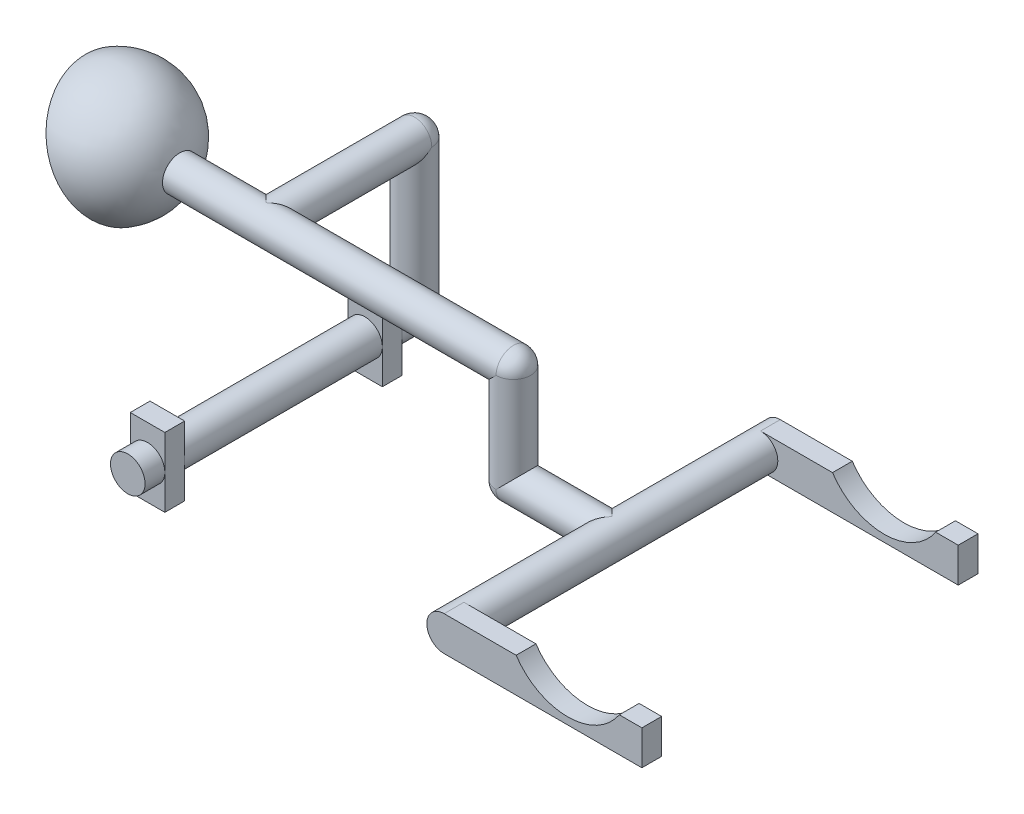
ISO-10303-21;
HEADER;
FILE_DESCRIPTION(('STEP AP214'),'2;1');
FILE_NAME('part.step','',(''),(''),'','','');
FILE_SCHEMA(('AUTOMOTIVE_DESIGN { 1 0 10303 214 1 1 1 1 }'));
ENDSEC;
DATA;
#1=APPLICATION_CONTEXT('core data for automotive mechanical design processes');
#2=APPLICATION_PROTOCOL_DEFINITION('international standard','automotive_design',2000,#1);
#3=PRODUCT_CONTEXT('',#1,'mechanical');
#4=PRODUCT('Part','Part','',(#3));
#5=PRODUCT_RELATED_PRODUCT_CATEGORY('part','',(#4));
#6=PRODUCT_DEFINITION_FORMATION('','',#4);
#7=PRODUCT_DEFINITION_CONTEXT('part definition',#1,'design');
#8=PRODUCT_DEFINITION('design','',#6,#7);
#9=PRODUCT_DEFINITION_SHAPE('','',#8);
#10=(LENGTH_UNIT() NAMED_UNIT(*) SI_UNIT(.MILLI.,.METRE.));
#11=(NAMED_UNIT(*) PLANE_ANGLE_UNIT() SI_UNIT($,.RADIAN.));
#12=(NAMED_UNIT(*) SI_UNIT($,.STERADIAN.) SOLID_ANGLE_UNIT());
#13=UNCERTAINTY_MEASURE_WITH_UNIT(LENGTH_MEASURE(1.E-05),#10,'distance_accuracy_value','');
#14=(GEOMETRIC_REPRESENTATION_CONTEXT(3) GLOBAL_UNCERTAINTY_ASSIGNED_CONTEXT((#13)) GLOBAL_UNIT_ASSIGNED_CONTEXT((#10,
#11,#12)) REPRESENTATION_CONTEXT('',''));
#15=CARTESIAN_POINT('',(0.,0.,0.));
#16=DIRECTION('',(0.,0.,1.));
#17=DIRECTION('',(1.,0.,0.));
#18=AXIS2_PLACEMENT_3D('',#15,#16,#17);
#19=CARTESIAN_POINT('',(-36.5286945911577,11.2417145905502,-24.));
#20=DIRECTION('',(0.864747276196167,0.502207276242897,0.));
#21=DIRECTION('',(-0.502207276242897,0.864747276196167,0.));
#22=AXIS2_PLACEMENT_3D('',#19,#20,#21);
#23=PLANE('',#22);
#24=CARTESIAN_POINT('',(-30.,0.,0.));
#25=DIRECTION('',(0.864747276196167,0.502207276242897,0.));
#26=DIRECTION('',(-0.502207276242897,0.864747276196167,0.));
#27=AXIS2_PLACEMENT_3D('',#24,#25,#26);
#28=CIRCLE('',#27,13.);
#29=CARTESIAN_POINT('',(-36.5286945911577,11.2417145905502,0.));
#30=VERTEX_POINT('',#29);
#31=EDGE_CURVE('E11',#30,#30,#28,.T.);
#32=ORIENTED_EDGE('',*,*,#31,.F.);
#33=EDGE_LOOP('',(#32));
#34=FACE_BOUND('',#33,.T.);
#35=CARTESIAN_POINT('',(-30.,0.,0.));
#36=DIRECTION('',(0.864747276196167,0.502207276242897,0.));
#37=DIRECTION('',(-0.502207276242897,0.864747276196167,0.));
#38=AXIS2_PLACEMENT_3D('',#35,#36,#37);
#39=CIRCLE('',#38,10.);
#40=CARTESIAN_POINT('',(-35.022072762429,8.64747276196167,0.));
#41=VERTEX_POINT('',#40);
#42=EDGE_CURVE('E36',#41,#41,#39,.F.);
#43=ORIENTED_EDGE('',*,*,#42,.F.);
#44=EDGE_LOOP('',(#43));
#45=FACE_BOUND('',#44,.T.);
#46=ADVANCED_FACE('F32',(#34,#45),#23,.F.);
#47=CARTESIAN_POINT('',(34.9353180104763,-20.,0.));
#48=DIRECTION('',(-1.,0.,0.));
#49=DIRECTION('',(0.,0.,1.));
#50=AXIS2_PLACEMENT_3D('',#47,#48,#49);
#51=CYLINDRICAL_SURFACE('',#50,3.5);
#52=CARTESIAN_POINT('',(50.,-20.,0.));
#53=DIRECTION('',(-0.707106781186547,0.707106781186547,0.));
#54=DIRECTION('',(0.707106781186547,0.707106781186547,0.));
#55=AXIS2_PLACEMENT_3D('',#52,#53,#54);
#56=ELLIPSE('',#55,4.94974746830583,3.5);
#57=CARTESIAN_POINT('',(50.,-20.,3.5));
#58=VERTEX_POINT('',#57);
#59=CARTESIAN_POINT('',(50.,-20.,-3.5));
#60=VERTEX_POINT('',#59);
#61=EDGE_CURVE('E249',#58,#60,#56,.T.);
#62=ORIENTED_EDGE('',*,*,#61,.F.);
#63=CARTESIAN_POINT('',(50.,-20.,0.));
#64=DIRECTION('',(-1.,0.,0.));
#65=DIRECTION('',(0.,0.,1.));
#66=AXIS2_PLACEMENT_3D('',#63,#64,#65);
#67=CIRCLE('',#66,3.5);
#68=EDGE_CURVE('E253',#60,#58,#67,.T.);
#69=ORIENTED_EDGE('',*,*,#68,.F.);
#70=EDGE_LOOP('',(#62,#69));
#71=FACE_BOUND('',#70,.T.);
#72=CARTESIAN_POINT('',(70.,-20.,0.));
#73=DIRECTION('',(-0.707106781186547,0.,-0.707106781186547));
#74=DIRECTION('',(-0.707106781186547,0.,0.707106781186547));
#75=AXIS2_PLACEMENT_3D('',#72,#73,#74);
#76=ELLIPSE('',#75,4.94974746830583,3.5);
#77=CARTESIAN_POINT('',(70.,-16.5,0.));
#78=VERTEX_POINT('',#77);
#79=CARTESIAN_POINT('',(70.,-23.5,0.));
#80=VERTEX_POINT('',#79);
#81=EDGE_CURVE('E481',#78,#80,#76,.F.);
#82=ORIENTED_EDGE('',*,*,#81,.F.);
#83=CARTESIAN_POINT('',(70.,-20.,0.));
#84=DIRECTION('',(-0.707106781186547,0.,0.707106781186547));
#85=DIRECTION('',(-0.707106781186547,0.,-0.707106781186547));
#86=AXIS2_PLACEMENT_3D('',#83,#84,#85);
#87=ELLIPSE('',#86,4.94974746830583,3.5);
#88=EDGE_CURVE('E371',#80,#78,#87,.F.);
#89=ORIENTED_EDGE('',*,*,#88,.F.);
#90=EDGE_LOOP('',(#82,#89));
#91=FACE_BOUND('',#90,.T.);
#92=ADVANCED_FACE('F489',(#71,#91),#51,.T.);
#93=CARTESIAN_POINT('',(50.,-20.,0.));
#94=DIRECTION('',(0.,1.,0.));
#95=DIRECTION('',(0.,0.,1.));
#96=AXIS2_PLACEMENT_3D('',#93,#94,#95);
#97=CYLINDRICAL_SURFACE('',#96,3.5);
#98=CARTESIAN_POINT('',(50.,0.,0.));
#99=DIRECTION('',(-0.707106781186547,0.707106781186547,0.));
#100=DIRECTION('',(-0.707106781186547,-0.707106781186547,0.));
#101=AXIS2_PLACEMENT_3D('',#98,#99,#100);
#102=ELLIPSE('',#101,4.94974746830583,3.5);
#103=CARTESIAN_POINT('',(50.,0.,-3.5));
#104=VERTEX_POINT('',#103);
#105=CARTESIAN_POINT('',(50.,0.,3.5));
#106=VERTEX_POINT('',#105);
#107=EDGE_CURVE('E231',#104,#106,#102,.T.);
#108=ORIENTED_EDGE('',*,*,#107,.F.);
#109=CARTESIAN_POINT('',(50.,0.,0.));
#110=DIRECTION('',(0.,1.,0.));
#111=DIRECTION('',(0.,0.,1.));
#112=AXIS2_PLACEMENT_3D('',#109,#110,#111);
#113=CIRCLE('',#112,3.5);
#114=EDGE_CURVE('E236',#106,#104,#113,.T.);
#115=ORIENTED_EDGE('',*,*,#114,.F.);
#116=EDGE_LOOP('',(#108,#115));
#117=FACE_BOUND('',#116,.T.);
#118=CARTESIAN_POINT('',(50.,-20.,0.));
#119=DIRECTION('',(0.,1.,0.));
#120=DIRECTION('',(0.,0.,1.));
#121=AXIS2_PLACEMENT_3D('',#118,#119,#120);
#122=CIRCLE('',#121,3.5);
#123=EDGE_CURVE('E240',#60,#58,#122,.T.);
#124=ORIENTED_EDGE('',*,*,#123,.T.);
#125=ORIENTED_EDGE('',*,*,#61,.T.);
#126=EDGE_LOOP('',(#124,#125));
#127=FACE_BOUND('',#126,.T.);
#128=ADVANCED_FACE('F233',(#117,#127),#97,.T.);
#129=CARTESIAN_POINT('',(50.,0.,0.));
#130=DIRECTION('',(-1.,0.,0.));
#131=DIRECTION('',(0.,0.,1.));
#132=AXIS2_PLACEMENT_3D('',#129,#130,#131);
#133=CYLINDRICAL_SURFACE('',#132,3.5);
#134=CARTESIAN_POINT('',(50.,0.,0.));
#135=DIRECTION('',(1.,0.,0.));
#136=DIRECTION('',(0.,0.,-1.));
#137=AXIS2_PLACEMENT_3D('',#134,#135,#136);
#138=CIRCLE('',#137,3.5);
#139=EDGE_CURVE('E242',#104,#106,#138,.T.);
#140=ORIENTED_EDGE('',*,*,#139,.F.);
#141=ORIENTED_EDGE('',*,*,#107,.T.);
#142=EDGE_LOOP('',(#140,#141));
#143=FACE_BOUND('',#142,.T.);
#144=CARTESIAN_POINT('',(0.,0.,0.));
#145=DIRECTION('',(-0.707106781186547,0.,-0.707106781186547));
#146=DIRECTION('',(-0.707106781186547,0.,0.707106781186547));
#147=AXIS2_PLACEMENT_3D('',#144,#145,#146);
#148=ELLIPSE('',#147,4.94974746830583,3.5);
#149=CARTESIAN_POINT('',(0.,-3.5,0.));
#150=VERTEX_POINT('',#149);
#151=CARTESIAN_POINT('',(0.,3.5,0.));
#152=VERTEX_POINT('',#151);
#153=EDGE_CURVE('E245',#150,#152,#148,.F.);
#154=ORIENTED_EDGE('',*,*,#153,.T.);
#155=CARTESIAN_POINT('',(0.,0.,0.));
#156=DIRECTION('',(-0.707106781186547,0.,0.707106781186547));
#157=DIRECTION('',(-0.707106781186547,0.,-0.707106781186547));
#158=AXIS2_PLACEMENT_3D('',#155,#156,#157);
#159=ELLIPSE('',#158,4.94974746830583,3.5);
#160=EDGE_CURVE('E363',#152,#150,#159,.T.);
#161=ORIENTED_EDGE('',*,*,#160,.T.);
#162=EDGE_LOOP('',(#154,#161));
#163=FACE_BOUND('',#162,.T.);
#164=CARTESIAN_POINT('',(-17.4800159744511,0.,0.));
#165=DIRECTION('',(-1.,0.,0.));
#166=DIRECTION('',(0.,0.,1.));
#167=AXIS2_PLACEMENT_3D('',#164,#165,#166);
#168=CIRCLE('',#167,3.5);
#169=CARTESIAN_POINT('',(-17.4800159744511,0.,3.5));
#170=VERTEX_POINT('',#169);
#171=EDGE_CURVE('E41',#170,#170,#168,.T.);
#172=ORIENTED_EDGE('',*,*,#171,.F.);
#173=EDGE_LOOP('',(#172));
#174=FACE_BOUND('',#173,.T.);
#175=ADVANCED_FACE('F34',(#143,#163,#174),#133,.T.);
#176=CARTESIAN_POINT('',(-3.5,-37.,24.));
#177=DIRECTION('',(0.,0.,1.));
#178=DIRECTION('',(1.,0.,0.));
#179=AXIS2_PLACEMENT_3D('',#176,#177,#178);
#180=PLANE('',#179);
#181=CARTESIAN_POINT('',(0.,-30.,24.));
#182=DIRECTION('',(0.,0.,1.));
#183=DIRECTION('',(1.,0.,0.));
#184=AXIS2_PLACEMENT_3D('',#181,#182,#183);
#185=CIRCLE('',#184,3.5);
#186=CARTESIAN_POINT('',(3.5,-30.,24.));
#187=VERTEX_POINT('',#186);
#188=CARTESIAN_POINT('',(-3.5,-30.,24.));
#189=VERTEX_POINT('',#188);
#190=EDGE_CURVE('E239',#187,#189,#185,.T.);
#191=ORIENTED_EDGE('',*,*,#190,.F.);
#192=DIRECTION('',(0.,1.,0.));
#193=VECTOR('',#192,1.);
#194=CARTESIAN_POINT('',(3.5,-37.,24.));
#195=LINE('',#194,#193);
#196=CARTESIAN_POINT('',(3.5,-23.,24.));
#197=VERTEX_POINT('',#196);
#198=EDGE_CURVE('E283',#187,#197,#195,.T.);
#199=ORIENTED_EDGE('',*,*,#198,.T.);
#200=DIRECTION('',(-1.,0.,0.));
#201=VECTOR('',#200,1.);
#202=CARTESIAN_POINT('',(3.5,-23.,24.));
#203=LINE('',#202,#201);
#204=CARTESIAN_POINT('',(-3.5,-23.,24.));
#205=VERTEX_POINT('',#204);
#206=EDGE_CURVE('E286',#197,#205,#203,.T.);
#207=ORIENTED_EDGE('',*,*,#206,.T.);
#208=DIRECTION('',(0.,-1.,0.));
#209=VECTOR('',#208,1.);
#210=CARTESIAN_POINT('',(-3.5,-23.,24.));
#211=LINE('',#210,#209);
#212=EDGE_CURVE('E278',#205,#189,#211,.T.);
#213=ORIENTED_EDGE('',*,*,#212,.T.);
#214=EDGE_LOOP('',(#191,#199,#207,#213));
#215=FACE_BOUND('',#214,.T.);
#216=ADVANCED_FACE('F497',(#215),#180,.T.);
#217=CARTESIAN_POINT('',(3.5,-37.,-20.));
#218=DIRECTION('',(0.,0.,-1.));
#219=DIRECTION('',(-1.,0.,0.));
#220=AXIS2_PLACEMENT_3D('',#217,#218,#219);
#221=PLANE('',#220);
#222=CARTESIAN_POINT('',(0.,-30.,-20.));
#223=DIRECTION('',(0.,0.,1.));
#224=DIRECTION('',(1.,0.,0.));
#225=AXIS2_PLACEMENT_3D('',#222,#223,#224);
#226=CIRCLE('',#225,3.5);
#227=CARTESIAN_POINT('',(3.5,-30.,-20.));
#228=VERTEX_POINT('',#227);
#229=CARTESIAN_POINT('',(-3.5,-30.,-20.));
#230=VERTEX_POINT('',#229);
#231=EDGE_CURVE('E300',#228,#230,#226,.T.);
#232=ORIENTED_EDGE('',*,*,#231,.F.);
#233=DIRECTION('',(0.,1.,0.));
#234=VECTOR('',#233,1.);
#235=CARTESIAN_POINT('',(3.5,-23.,-20.));
#236=LINE('',#235,#234);
#237=CARTESIAN_POINT('',(3.5,-23.,-20.));
#238=VERTEX_POINT('',#237);
#239=EDGE_CURVE('E319',#228,#238,#236,.T.);
#240=ORIENTED_EDGE('',*,*,#239,.T.);
#241=DIRECTION('',(-1.,0.,0.));
#242=VECTOR('',#241,1.);
#243=CARTESIAN_POINT('',(3.5,-23.,-20.));
#244=LINE('',#243,#242);
#245=CARTESIAN_POINT('',(-3.5,-23.,-20.));
#246=VERTEX_POINT('',#245);
#247=EDGE_CURVE('E322',#238,#246,#244,.T.);
#248=ORIENTED_EDGE('',*,*,#247,.T.);
#249=DIRECTION('',(0.,-1.,0.));
#250=VECTOR('',#249,1.);
#251=CARTESIAN_POINT('',(-3.5,-23.,-20.));
#252=LINE('',#251,#250);
#253=EDGE_CURVE('E325',#246,#230,#252,.T.);
#254=ORIENTED_EDGE('',*,*,#253,.T.);
#255=EDGE_LOOP('',(#232,#240,#248,#254));
#256=FACE_BOUND('',#255,.T.);
#257=ADVANCED_FACE('F631',(#256),#221,.F.);
#258=EDGE_CURVE('E304',#230,#228,#226,.T.);
#259=ORIENTED_EDGE('',*,*,#258,.F.);
#260=CARTESIAN_POINT('',(-3.5,-37.,-20.));
#261=VERTEX_POINT('',#260);
#262=EDGE_CURVE('E324',#230,#261,#252,.T.);
#263=ORIENTED_EDGE('',*,*,#262,.T.);
#264=DIRECTION('',(1.,0.,0.));
#265=VECTOR('',#264,1.);
#266=CARTESIAN_POINT('',(3.5,-37.,-20.));
#267=LINE('',#266,#265);
#268=CARTESIAN_POINT('',(3.5,-37.,-20.));
#269=VERTEX_POINT('',#268);
#270=EDGE_CURVE('E328',#261,#269,#267,.T.);
#271=ORIENTED_EDGE('',*,*,#270,.T.);
#272=EDGE_CURVE('E320',#269,#228,#236,.T.);
#273=ORIENTED_EDGE('',*,*,#272,.T.);
#274=EDGE_LOOP('',(#259,#263,#271,#273));
#275=FACE_BOUND('',#274,.T.);
#276=ADVANCED_FACE('F634',(#275),#221,.F.);
#277=CARTESIAN_POINT('',(0.,0.,-30.));
#278=DIRECTION('',(0.,0.,1.));
#279=DIRECTION('',(1.,0.,0.));
#280=AXIS2_PLACEMENT_3D('',#277,#278,#279);
#281=CYLINDRICAL_SURFACE('',#280,3.5);
#282=CARTESIAN_POINT('',(0.,0.,-30.));
#283=DIRECTION('',(0.,0.707106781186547,0.707106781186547));
#284=DIRECTION('',(0.,-0.707106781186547,0.707106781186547));
#285=AXIS2_PLACEMENT_3D('',#282,#283,#284);
#286=ELLIPSE('',#285,4.94974746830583,3.5);
#287=CARTESIAN_POINT('',(3.5,0.,-30.));
#288=VERTEX_POINT('',#287);
#289=CARTESIAN_POINT('',(-3.5,0.,-30.));
#290=VERTEX_POINT('',#289);
#291=EDGE_CURVE('E357',#288,#290,#286,.F.);
#292=ORIENTED_EDGE('',*,*,#291,.F.);
#293=CARTESIAN_POINT('',(0.,0.,-30.));
#294=DIRECTION('',(0.,0.,1.));
#295=DIRECTION('',(1.,0.,0.));
#296=AXIS2_PLACEMENT_3D('',#293,#294,#295);
#297=CIRCLE('',#296,3.5);
#298=EDGE_CURVE('E246',#288,#290,#297,.T.);
#299=ORIENTED_EDGE('',*,*,#298,.T.);
#300=EDGE_LOOP('',(#292,#299));
#301=FACE_BOUND('',#300,.T.);
#302=ORIENTED_EDGE('',*,*,#160,.F.);
#303=ORIENTED_EDGE('',*,*,#153,.F.);
#304=EDGE_LOOP('',(#302,#303));
#305=FACE_BOUND('',#304,.T.);
#306=ADVANCED_FACE('F656',(#301,#305),#281,.T.);
#307=CARTESIAN_POINT('',(0.,-30.,-30.));
#308=DIRECTION('',(0.,1.,0.));
#309=DIRECTION('',(0.,0.,1.));
#310=AXIS2_PLACEMENT_3D('',#307,#308,#309);
#311=CYLINDRICAL_SURFACE('',#310,3.5);
#312=CARTESIAN_POINT('',(0.,-30.,-30.));
#313=DIRECTION('',(0.,0.707106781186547,-0.707106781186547));
#314=DIRECTION('',(0.,0.707106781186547,0.707106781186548));
#315=AXIS2_PLACEMENT_3D('',#312,#313,#314);
#316=ELLIPSE('',#315,4.94974746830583,3.5);
#317=CARTESIAN_POINT('',(3.5,-30.,-30.));
#318=VERTEX_POINT('',#317);
#319=CARTESIAN_POINT('',(-3.5,-30.,-30.));
#320=VERTEX_POINT('',#319);
#321=EDGE_CURVE('E349',#318,#320,#316,.F.);
#322=ORIENTED_EDGE('',*,*,#321,.F.);
#323=CARTESIAN_POINT('',(0.,-30.,-30.));
#324=DIRECTION('',(0.,1.,0.));
#325=DIRECTION('',(0.,0.,1.));
#326=AXIS2_PLACEMENT_3D('',#323,#324,#325);
#327=CIRCLE('',#326,3.5);
#328=EDGE_CURVE('E355',#318,#320,#327,.T.);
#329=ORIENTED_EDGE('',*,*,#328,.T.);
#330=EDGE_LOOP('',(#322,#329));
#331=FACE_BOUND('',#330,.T.);
#332=CARTESIAN_POINT('',(0.,0.,-30.));
#333=DIRECTION('',(0.,1.,0.));
#334=DIRECTION('',(0.,0.,1.));
#335=AXIS2_PLACEMENT_3D('',#332,#333,#334);
#336=CIRCLE('',#335,3.5);
#337=EDGE_CURVE('E352',#288,#290,#336,.T.);
#338=ORIENTED_EDGE('',*,*,#337,.F.);
#339=ORIENTED_EDGE('',*,*,#291,.T.);
#340=EDGE_LOOP('',(#338,#339));
#341=FACE_BOUND('',#340,.T.);
#342=ADVANCED_FACE('F653',(#331,#341),#311,.T.);
#343=CARTESIAN_POINT('',(0.,-30.,-33.3032163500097));
#344=DIRECTION('',(0.,0.,-1.));
#345=DIRECTION('',(0.,1.,0.));
#346=AXIS2_PLACEMENT_3D('',#343,#344,#345);
#347=CYLINDRICAL_SURFACE('',#346,3.5);
#348=CARTESIAN_POINT('',(0.,-30.,-24.));
#349=DIRECTION('',(0.,0.,-1.));
#350=DIRECTION('',(0.,1.,0.));
#351=AXIS2_PLACEMENT_3D('',#348,#349,#350);
#352=CIRCLE('',#351,3.5);
#353=CARTESIAN_POINT('',(3.5,-30.,-24.));
#354=VERTEX_POINT('',#353);
#355=CARTESIAN_POINT('',(-3.5,-30.,-24.));
#356=VERTEX_POINT('',#355);
#357=EDGE_CURVE('E343',#354,#356,#352,.T.);
#358=ORIENTED_EDGE('',*,*,#357,.T.);
#359=EDGE_CURVE('E342',#356,#354,#352,.T.);
#360=ORIENTED_EDGE('',*,*,#359,.T.);
#361=EDGE_LOOP('',(#358,#360));
#362=FACE_BOUND('',#361,.T.);
#363=CARTESIAN_POINT('',(0.,-30.,-30.));
#364=DIRECTION('',(0.,0.,-1.));
#365=DIRECTION('',(0.,1.,0.));
#366=AXIS2_PLACEMENT_3D('',#363,#364,#365);
#367=CIRCLE('',#366,3.5);
#368=EDGE_CURVE('E346',#318,#320,#367,.T.);
#369=ORIENTED_EDGE('',*,*,#368,.F.);
#370=ORIENTED_EDGE('',*,*,#321,.T.);
#371=EDGE_LOOP('',(#369,#370));
#372=FACE_BOUND('',#371,.T.);
#373=ADVANCED_FACE('F629',(#362,#372),#347,.T.);
#374=CARTESIAN_POINT('',(3.5,-37.,-24.));
#375=DIRECTION('',(0.,0.,-1.));
#376=DIRECTION('',(-1.,0.,0.));
#377=AXIS2_PLACEMENT_3D('',#374,#375,#376);
#378=PLANE('',#377);
#379=ORIENTED_EDGE('',*,*,#357,.F.);
#380=DIRECTION('',(0.,1.,0.));
#381=VECTOR('',#380,1.);
#382=CARTESIAN_POINT('',(3.5,-23.,-24.));
#383=LINE('',#382,#381);
#384=CARTESIAN_POINT('',(3.5,-37.,-24.));
#385=VERTEX_POINT('',#384);
#386=EDGE_CURVE('E309',#385,#354,#383,.T.);
#387=ORIENTED_EDGE('',*,*,#386,.F.);
#388=DIRECTION('',(1.,0.,0.));
#389=VECTOR('',#388,1.);
#390=CARTESIAN_POINT('',(3.5,-37.,-24.));
#391=LINE('',#390,#389);
#392=CARTESIAN_POINT('',(-3.5,-37.,-24.));
#393=VERTEX_POINT('',#392);
#394=EDGE_CURVE('E317',#393,#385,#391,.T.);
#395=ORIENTED_EDGE('',*,*,#394,.F.);
#396=DIRECTION('',(0.,-1.,0.));
#397=VECTOR('',#396,1.);
#398=CARTESIAN_POINT('',(-3.5,-23.,-24.));
#399=LINE('',#398,#397);
#400=EDGE_CURVE('E313',#356,#393,#399,.T.);
#401=ORIENTED_EDGE('',*,*,#400,.F.);
#402=EDGE_LOOP('',(#379,#387,#395,#401));
#403=FACE_BOUND('',#402,.T.);
#404=ADVANCED_FACE('F625',(#403),#378,.T.);
#405=ORIENTED_EDGE('',*,*,#359,.F.);
#406=CARTESIAN_POINT('',(-3.5,-23.,-24.));
#407=VERTEX_POINT('',#406);
#408=EDGE_CURVE('E314',#407,#356,#399,.T.);
#409=ORIENTED_EDGE('',*,*,#408,.F.);
#410=DIRECTION('',(-1.,0.,0.));
#411=VECTOR('',#410,1.);
#412=CARTESIAN_POINT('',(3.5,-23.,-24.));
#413=LINE('',#412,#411);
#414=CARTESIAN_POINT('',(3.5,-23.,-24.));
#415=VERTEX_POINT('',#414);
#416=EDGE_CURVE('E311',#415,#407,#413,.T.);
#417=ORIENTED_EDGE('',*,*,#416,.F.);
#418=EDGE_CURVE('E308',#354,#415,#383,.T.);
#419=ORIENTED_EDGE('',*,*,#418,.F.);
#420=EDGE_LOOP('',(#405,#409,#417,#419));
#421=FACE_BOUND('',#420,.T.);
#422=ADVANCED_FACE('F628',(#421),#378,.T.);
#423=CARTESIAN_POINT('',(3.5,-23.,-20.));
#424=DIRECTION('',(-1.,0.,0.));
#425=DIRECTION('',(0.,-1.,0.));
#426=AXIS2_PLACEMENT_3D('',#423,#424,#425);
#427=PLANE('',#426);
#428=ORIENTED_EDGE('',*,*,#386,.T.);
#429=ORIENTED_EDGE('',*,*,#418,.T.);
#430=DIRECTION('',(0.,0.,-1.));
#431=VECTOR('',#430,1.);
#432=CARTESIAN_POINT('',(3.5,-23.,-20.));
#433=LINE('',#432,#431);
#434=EDGE_CURVE('E339',#238,#415,#433,.T.);
#435=ORIENTED_EDGE('',*,*,#434,.F.);
#436=ORIENTED_EDGE('',*,*,#239,.F.);
#437=ORIENTED_EDGE('',*,*,#272,.F.);
#438=DIRECTION('',(0.,0.,-1.));
#439=VECTOR('',#438,1.);
#440=CARTESIAN_POINT('',(3.5,-37.,-20.));
#441=LINE('',#440,#439);
#442=EDGE_CURVE('E330',#269,#385,#441,.T.);
#443=ORIENTED_EDGE('',*,*,#442,.T.);
#444=EDGE_LOOP('',(#428,#429,#435,#436,#437,#443));
#445=FACE_BOUND('',#444,.T.);
#446=ADVANCED_FACE('F646',(#445),#427,.F.);
#447=CARTESIAN_POINT('',(3.5,-23.,-20.));
#448=DIRECTION('',(0.,-1.,0.));
#449=DIRECTION('',(0.,0.,-1.));
#450=AXIS2_PLACEMENT_3D('',#447,#448,#449);
#451=PLANE('',#450);
#452=ORIENTED_EDGE('',*,*,#416,.T.);
#453=DIRECTION('',(0.,0.,-1.));
#454=VECTOR('',#453,1.);
#455=CARTESIAN_POINT('',(-3.5,-23.,-20.));
#456=LINE('',#455,#454);
#457=EDGE_CURVE('E336',#246,#407,#456,.T.);
#458=ORIENTED_EDGE('',*,*,#457,.F.);
#459=ORIENTED_EDGE('',*,*,#247,.F.);
#460=ORIENTED_EDGE('',*,*,#434,.T.);
#461=EDGE_LOOP('',(#452,#458,#459,#460));
#462=FACE_BOUND('',#461,.T.);
#463=ADVANCED_FACE('F642',(#462),#451,.F.);
#464=CARTESIAN_POINT('',(-3.5,-23.,-20.));
#465=DIRECTION('',(1.,0.,0.));
#466=DIRECTION('',(0.,1.,0.));
#467=AXIS2_PLACEMENT_3D('',#464,#465,#466);
#468=PLANE('',#467);
#469=ORIENTED_EDGE('',*,*,#408,.T.);
#470=ORIENTED_EDGE('',*,*,#400,.T.);
#471=DIRECTION('',(0.,0.,-1.));
#472=VECTOR('',#471,1.);
#473=CARTESIAN_POINT('',(-3.5,-37.,-20.));
#474=LINE('',#473,#472);
#475=EDGE_CURVE('E333',#261,#393,#474,.T.);
#476=ORIENTED_EDGE('',*,*,#475,.F.);
#477=ORIENTED_EDGE('',*,*,#262,.F.);
#478=ORIENTED_EDGE('',*,*,#253,.F.);
#479=ORIENTED_EDGE('',*,*,#457,.T.);
#480=EDGE_LOOP('',(#469,#470,#476,#477,#478,#479));
#481=FACE_BOUND('',#480,.T.);
#482=ADVANCED_FACE('F638',(#481),#468,.F.);
#483=CARTESIAN_POINT('',(3.5,-37.,-20.));
#484=DIRECTION('',(0.,1.,0.));
#485=DIRECTION('',(0.,0.,1.));
#486=AXIS2_PLACEMENT_3D('',#483,#484,#485);
#487=PLANE('',#486);
#488=ORIENTED_EDGE('',*,*,#394,.T.);
#489=ORIENTED_EDGE('',*,*,#442,.F.);
#490=ORIENTED_EDGE('',*,*,#270,.F.);
#491=ORIENTED_EDGE('',*,*,#475,.T.);
#492=EDGE_LOOP('',(#488,#489,#490,#491));
#493=FACE_BOUND('',#492,.T.);
#494=ADVANCED_FACE('F623',(#493),#487,.F.);
#495=CARTESIAN_POINT('',(0.,-30.,20.));
#496=DIRECTION('',(0.,0.,-1.));
#497=DIRECTION('',(-1.,0.,0.));
#498=AXIS2_PLACEMENT_3D('',#495,#496,#497);
#499=CYLINDRICAL_SURFACE('',#498,3.5);
#500=ORIENTED_EDGE('',*,*,#231,.T.);
#501=ORIENTED_EDGE('',*,*,#258,.T.);
#502=EDGE_LOOP('',(#500,#501));
#503=FACE_BOUND('',#502,.T.);
#504=CARTESIAN_POINT('',(0.,-30.,20.));
#505=DIRECTION('',(0.,0.,1.));
#506=DIRECTION('',(1.,0.,0.));
#507=AXIS2_PLACEMENT_3D('',#504,#505,#506);
#508=CIRCLE('',#507,3.5);
#509=CARTESIAN_POINT('',(3.5,-30.,20.));
#510=VERTEX_POINT('',#509);
#511=CARTESIAN_POINT('',(-3.5,-30.,20.));
#512=VERTEX_POINT('',#511);
#513=EDGE_CURVE('E305',#510,#512,#508,.T.);
#514=ORIENTED_EDGE('',*,*,#513,.F.);
#515=EDGE_CURVE('E303',#512,#510,#508,.T.);
#516=ORIENTED_EDGE('',*,*,#515,.F.);
#517=EDGE_LOOP('',(#514,#516));
#518=FACE_BOUND('',#517,.T.);
#519=ADVANCED_FACE('F600',(#503,#518),#499,.T.);
#520=CARTESIAN_POINT('',(-3.5,-37.,20.));
#521=DIRECTION('',(0.,0.,1.));
#522=DIRECTION('',(1.,0.,0.));
#523=AXIS2_PLACEMENT_3D('',#520,#521,#522);
#524=PLANE('',#523);
#525=DIRECTION('',(0.,1.,0.));
#526=VECTOR('',#525,1.);
#527=CARTESIAN_POINT('',(3.5,-30.,20.));
#528=LINE('',#527,#526);
#529=CARTESIAN_POINT('',(3.5,-23.,20.));
#530=VERTEX_POINT('',#529);
#531=EDGE_CURVE('E270',#510,#530,#528,.T.);
#532=ORIENTED_EDGE('',*,*,#531,.F.);
#533=ORIENTED_EDGE('',*,*,#513,.T.);
#534=DIRECTION('',(0.,-1.,0.));
#535=VECTOR('',#534,1.);
#536=CARTESIAN_POINT('',(-3.5,-30.,20.));
#537=LINE('',#536,#535);
#538=CARTESIAN_POINT('',(-3.5,-23.,20.));
#539=VERTEX_POINT('',#538);
#540=EDGE_CURVE('E264',#539,#512,#537,.T.);
#541=ORIENTED_EDGE('',*,*,#540,.F.);
#542=DIRECTION('',(-1.,0.,0.));
#543=VECTOR('',#542,1.);
#544=CARTESIAN_POINT('',(3.5,-23.,20.));
#545=LINE('',#544,#543);
#546=EDGE_CURVE('E274',#530,#539,#545,.T.);
#547=ORIENTED_EDGE('',*,*,#546,.F.);
#548=EDGE_LOOP('',(#532,#533,#541,#547));
#549=FACE_BOUND('',#548,.T.);
#550=ADVANCED_FACE('F596',(#549),#524,.F.);
#551=CARTESIAN_POINT('',(-3.5,-37.,20.));
#552=VERTEX_POINT('',#551);
#553=EDGE_CURVE('E263',#512,#552,#537,.T.);
#554=ORIENTED_EDGE('',*,*,#553,.F.);
#555=ORIENTED_EDGE('',*,*,#515,.T.);
#556=CARTESIAN_POINT('',(3.5,-37.,20.));
#557=VERTEX_POINT('',#556);
#558=EDGE_CURVE('E271',#557,#510,#528,.T.);
#559=ORIENTED_EDGE('',*,*,#558,.F.);
#560=DIRECTION('',(1.,0.,0.));
#561=VECTOR('',#560,1.);
#562=CARTESIAN_POINT('',(-3.5,-37.,20.));
#563=LINE('',#562,#561);
#564=EDGE_CURVE('E267',#552,#557,#563,.T.);
#565=ORIENTED_EDGE('',*,*,#564,.F.);
#566=EDGE_LOOP('',(#554,#555,#559,#565));
#567=FACE_BOUND('',#566,.T.);
#568=ADVANCED_FACE('F599',(#567),#524,.F.);
#569=CARTESIAN_POINT('',(-3.5,-30.,24.));
#570=DIRECTION('',(1.,0.,0.));
#571=DIRECTION('',(0.,1.,0.));
#572=AXIS2_PLACEMENT_3D('',#569,#570,#571);
#573=PLANE('',#572);
#574=ORIENTED_EDGE('',*,*,#540,.T.);
#575=ORIENTED_EDGE('',*,*,#553,.T.);
#576=DIRECTION('',(0.,0.,-1.));
#577=VECTOR('',#576,1.);
#578=CARTESIAN_POINT('',(-3.5,-37.,24.));
#579=LINE('',#578,#577);
#580=CARTESIAN_POINT('',(-3.5,-37.,24.));
#581=VERTEX_POINT('',#580);
#582=EDGE_CURVE('E297',#581,#552,#579,.T.);
#583=ORIENTED_EDGE('',*,*,#582,.F.);
#584=EDGE_CURVE('E277',#189,#581,#211,.T.);
#585=ORIENTED_EDGE('',*,*,#584,.F.);
#586=ORIENTED_EDGE('',*,*,#212,.F.);
#587=DIRECTION('',(0.,0.,-1.));
#588=VECTOR('',#587,1.);
#589=CARTESIAN_POINT('',(-3.5,-23.,24.));
#590=LINE('',#589,#588);
#591=EDGE_CURVE('E288',#205,#539,#590,.T.);
#592=ORIENTED_EDGE('',*,*,#591,.T.);
#593=EDGE_LOOP('',(#574,#575,#583,#585,#586,#592));
#594=FACE_BOUND('',#593,.T.);
#595=ADVANCED_FACE('F616',(#594),#573,.F.);
#596=CARTESIAN_POINT('',(-3.5,-37.,24.));
#597=DIRECTION('',(0.,1.,0.));
#598=DIRECTION('',(0.,0.,1.));
#599=AXIS2_PLACEMENT_3D('',#596,#597,#598);
#600=PLANE('',#599);
#601=ORIENTED_EDGE('',*,*,#564,.T.);
#602=DIRECTION('',(0.,0.,-1.));
#603=VECTOR('',#602,1.);
#604=CARTESIAN_POINT('',(3.5,-37.,24.));
#605=LINE('',#604,#603);
#606=CARTESIAN_POINT('',(3.5,-37.,24.));
#607=VERTEX_POINT('',#606);
#608=EDGE_CURVE('E294',#607,#557,#605,.T.);
#609=ORIENTED_EDGE('',*,*,#608,.F.);
#610=DIRECTION('',(1.,0.,0.));
#611=VECTOR('',#610,1.);
#612=CARTESIAN_POINT('',(-3.5,-37.,24.));
#613=LINE('',#612,#611);
#614=EDGE_CURVE('E281',#581,#607,#613,.T.);
#615=ORIENTED_EDGE('',*,*,#614,.F.);
#616=ORIENTED_EDGE('',*,*,#582,.T.);
#617=EDGE_LOOP('',(#601,#609,#615,#616));
#618=FACE_BOUND('',#617,.T.);
#619=ADVANCED_FACE('F612',(#618),#600,.F.);
#620=CARTESIAN_POINT('',(3.5,-30.,24.));
#621=DIRECTION('',(-1.,0.,0.));
#622=DIRECTION('',(0.,-1.,0.));
#623=AXIS2_PLACEMENT_3D('',#620,#621,#622);
#624=PLANE('',#623);
#625=ORIENTED_EDGE('',*,*,#558,.T.);
#626=ORIENTED_EDGE('',*,*,#531,.T.);
#627=DIRECTION('',(0.,0.,-1.));
#628=VECTOR('',#627,1.);
#629=CARTESIAN_POINT('',(3.5,-23.,24.));
#630=LINE('',#629,#628);
#631=EDGE_CURVE('E291',#197,#530,#630,.T.);
#632=ORIENTED_EDGE('',*,*,#631,.F.);
#633=ORIENTED_EDGE('',*,*,#198,.F.);
#634=EDGE_CURVE('E284',#607,#187,#195,.T.);
#635=ORIENTED_EDGE('',*,*,#634,.F.);
#636=ORIENTED_EDGE('',*,*,#608,.T.);
#637=EDGE_LOOP('',(#625,#626,#632,#633,#635,#636));
#638=FACE_BOUND('',#637,.T.);
#639=ADVANCED_FACE('F608',(#638),#624,.F.);
#640=CARTESIAN_POINT('',(3.5,-23.,24.));
#641=DIRECTION('',(0.,-1.,0.));
#642=DIRECTION('',(0.,0.,-1.));
#643=AXIS2_PLACEMENT_3D('',#640,#641,#642);
#644=PLANE('',#643);
#645=ORIENTED_EDGE('',*,*,#546,.T.);
#646=ORIENTED_EDGE('',*,*,#591,.F.);
#647=ORIENTED_EDGE('',*,*,#206,.F.);
#648=ORIENTED_EDGE('',*,*,#631,.T.);
#649=EDGE_LOOP('',(#645,#646,#647,#648));
#650=FACE_BOUND('',#649,.T.);
#651=ADVANCED_FACE('F604',(#650),#644,.F.);
#652=EDGE_CURVE('E260',#189,#187,#185,.T.);
#653=ORIENTED_EDGE('',*,*,#652,.F.);
#654=ORIENTED_EDGE('',*,*,#584,.T.);
#655=ORIENTED_EDGE('',*,*,#614,.T.);
#656=ORIENTED_EDGE('',*,*,#634,.T.);
#657=EDGE_LOOP('',(#653,#654,#655,#656));
#658=FACE_BOUND('',#657,.T.);
#659=ADVANCED_FACE('F594',(#658),#180,.T.);
#660=CARTESIAN_POINT('',(0.,-30.,28.));
#661=DIRECTION('',(0.,0.,-1.));
#662=DIRECTION('',(-1.,0.,0.));
#663=AXIS2_PLACEMENT_3D('',#660,#661,#662);
#664=CYLINDRICAL_SURFACE('',#663,3.5);
#665=ORIENTED_EDGE('',*,*,#190,.T.);
#666=ORIENTED_EDGE('',*,*,#652,.T.);
#667=EDGE_LOOP('',(#665,#666));
#668=FACE_BOUND('',#667,.T.);
#669=CARTESIAN_POINT('',(0.,-30.,28.));
#670=DIRECTION('',(0.,0.,1.));
#671=DIRECTION('',(1.,0.,0.));
#672=AXIS2_PLACEMENT_3D('',#669,#670,#671);
#673=CIRCLE('',#672,3.5);
#674=CARTESIAN_POINT('',(3.5,-30.,28.));
#675=VERTEX_POINT('',#674);
#676=EDGE_CURVE('E259',#675,#675,#673,.T.);
#677=ORIENTED_EDGE('',*,*,#676,.F.);
#678=EDGE_LOOP('',(#677));
#679=FACE_BOUND('',#678,.T.);
#680=ADVANCED_FACE('F587',(#668,#679),#664,.T.);
#681=CARTESIAN_POINT('',(0.,-30.,28.));
#682=DIRECTION('',(0.,0.,1.));
#683=DIRECTION('',(1.,0.,0.));
#684=AXIS2_PLACEMENT_3D('',#681,#682,#683);
#685=PLANE('',#684);
#686=ORIENTED_EDGE('',*,*,#676,.T.);
#687=EDGE_LOOP('',(#686));
#688=FACE_BOUND('',#687,.T.);
#689=ADVANCED_FACE('F573',(#688),#685,.T.);
#690=CARTESIAN_POINT('',(-30.,0.,0.));
#691=DIRECTION('',(0.,1.,0.));
#692=DIRECTION('',(1.,0.,0.));
#693=AXIS2_PLACEMENT_3D('',#690,#691,#692);
#694=SPHERICAL_SURFACE('',#693,13.);
#695=ORIENTED_EDGE('',*,*,#31,.T.);
#696=EDGE_LOOP('',(#695));
#697=FACE_BOUND('',#696,.T.);
#698=ORIENTED_EDGE('',*,*,#171,.T.);
#699=EDGE_LOOP('',(#698));
#700=FACE_BOUND('',#699,.T.);
#701=ADVANCED_FACE('F568',(#697,#700),#694,.T.);
#702=CARTESIAN_POINT('',(70.,-20.,30.));
#703=DIRECTION('',(0.,0.,-1.));
#704=DIRECTION('',(-1.,0.,0.));
#705=AXIS2_PLACEMENT_3D('',#702,#703,#704);
#706=CYLINDRICAL_SURFACE('',#705,3.49999999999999);
#707=CARTESIAN_POINT('',(70.,-20.,-30.));
#708=DIRECTION('',(0.,0.,1.));
#709=DIRECTION('',(1.,0.,0.));
#710=AXIS2_PLACEMENT_3D('',#707,#708,#709);
#711=CIRCLE('',#710,3.49999999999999);
#712=CARTESIAN_POINT('',(70.,-23.5,-30.));
#713=VERTEX_POINT('',#712);
#714=CARTESIAN_POINT('',(70.,-16.5,-30.));
#715=VERTEX_POINT('',#714);
#716=EDGE_CURVE('E372',#713,#715,#711,.T.);
#717=ORIENTED_EDGE('',*,*,#716,.T.);
#718=DIRECTION('',(0.,0.,1.));
#719=VECTOR('',#718,1.);
#720=CARTESIAN_POINT('',(70.,-16.5,-34.));
#721=LINE('',#720,#719);
#722=CARTESIAN_POINT('',(70.,-16.5,-34.));
#723=VERTEX_POINT('',#722);
#724=EDGE_CURVE('E389',#723,#715,#721,.T.);
#725=ORIENTED_EDGE('',*,*,#724,.F.);
#726=CARTESIAN_POINT('',(70.,-20.,-34.));
#727=DIRECTION('',(0.,0.,1.));
#728=DIRECTION('',(1.,0.,0.));
#729=AXIS2_PLACEMENT_3D('',#726,#727,#728);
#730=CIRCLE('',#729,3.5);
#731=CARTESIAN_POINT('',(70.,-23.5,-34.));
#732=VERTEX_POINT('',#731);
#733=EDGE_CURVE('E420',#723,#732,#730,.T.);
#734=ORIENTED_EDGE('',*,*,#733,.T.);
#735=DIRECTION('',(0.,0.,1.));
#736=VECTOR('',#735,1.);
#737=CARTESIAN_POINT('',(70.,-23.5,-34.));
#738=LINE('',#737,#736);
#739=EDGE_CURVE('E410',#732,#713,#738,.T.);
#740=ORIENTED_EDGE('',*,*,#739,.T.);
#741=EDGE_LOOP('',(#717,#725,#734,#740));
#742=FACE_BOUND('',#741,.T.);
#743=CARTESIAN_POINT('',(70.,-20.,30.));
#744=DIRECTION('',(0.,0.,1.));
#745=DIRECTION('',(1.,0.,0.));
#746=AXIS2_PLACEMENT_3D('',#743,#744,#745);
#747=CIRCLE('',#746,3.49999999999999);
#748=CARTESIAN_POINT('',(70.,-23.5,30.));
#749=VERTEX_POINT('',#748);
#750=CARTESIAN_POINT('',(70.,-16.5,30.));
#751=VERTEX_POINT('',#750);
#752=EDGE_CURVE('E56',#749,#751,#747,.T.);
#753=ORIENTED_EDGE('',*,*,#752,.F.);
#754=DIRECTION('',(0.,0.,-1.));
#755=VECTOR('',#754,1.);
#756=CARTESIAN_POINT('',(70.,-23.5,34.));
#757=LINE('',#756,#755);
#758=CARTESIAN_POINT('',(70.,-23.5,34.));
#759=VERTEX_POINT('',#758);
#760=EDGE_CURVE('E392',#759,#749,#757,.T.);
#761=ORIENTED_EDGE('',*,*,#760,.F.);
#762=CARTESIAN_POINT('',(70.,-20.,34.));
#763=DIRECTION('',(0.,0.,1.));
#764=DIRECTION('',(1.,0.,0.));
#765=AXIS2_PLACEMENT_3D('',#762,#763,#764);
#766=CIRCLE('',#765,3.5);
#767=CARTESIAN_POINT('',(70.,-16.5,34.));
#768=VERTEX_POINT('',#767);
#769=EDGE_CURVE('E376',#768,#759,#766,.T.);
#770=ORIENTED_EDGE('',*,*,#769,.F.);
#771=DIRECTION('',(0.,0.,-1.));
#772=VECTOR('',#771,1.);
#773=CARTESIAN_POINT('',(70.,-16.5,34.));
#774=LINE('',#773,#772);
#775=EDGE_CURVE('E380',#768,#751,#774,.T.);
#776=ORIENTED_EDGE('',*,*,#775,.T.);
#777=EDGE_LOOP('',(#753,#761,#770,#776));
#778=FACE_BOUND('',#777,.T.);
#779=ORIENTED_EDGE('',*,*,#88,.T.);
#780=ORIENTED_EDGE('',*,*,#81,.T.);
#781=EDGE_LOOP('',(#779,#780));
#782=FACE_BOUND('',#781,.T.);
#783=ADVANCED_FACE('F543',(#742,#778,#782),#706,.T.);
#784=CARTESIAN_POINT('',(70.,-20.,30.));
#785=DIRECTION('',(0.,0.,1.));
#786=DIRECTION('',(1.,0.,0.));
#787=AXIS2_PLACEMENT_3D('',#784,#785,#786);
#788=PLANE('',#787);
#789=DIRECTION('',(1.,0.,0.));
#790=VECTOR('',#789,1.);
#791=CARTESIAN_POINT('',(70.,-23.5,30.));
#792=LINE('',#791,#790);
#793=CARTESIAN_POINT('',(110.,-23.5,30.));
#794=VERTEX_POINT('',#793);
#795=EDGE_CURVE('E386',#749,#794,#792,.T.);
#796=ORIENTED_EDGE('',*,*,#795,.F.);
#797=ORIENTED_EDGE('',*,*,#752,.T.);
#798=DIRECTION('',(-1.,0.,0.));
#799=VECTOR('',#798,1.);
#800=CARTESIAN_POINT('',(70.,-16.5,30.));
#801=LINE('',#800,#799);
#802=CARTESIAN_POINT('',(84.5649792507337,-16.5,30.));
#803=VERTEX_POINT('',#802);
#804=EDGE_CURVE('E373',#803,#751,#801,.T.);
#805=ORIENTED_EDGE('',*,*,#804,.F.);
#806=CARTESIAN_POINT('',(95.,-9.52735271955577,30.));
#807=DIRECTION('',(0.,0.,-1.));
#808=DIRECTION('',(1.,0.,0.));
#809=AXIS2_PLACEMENT_3D('',#806,#807,#808);
#810=CIRCLE('',#809,12.5501979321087);
#811=CARTESIAN_POINT('',(105.435020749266,-16.5,30.));
#812=VERTEX_POINT('',#811);
#813=EDGE_CURVE('E377',#812,#803,#810,.T.);
#814=ORIENTED_EDGE('',*,*,#813,.F.);
#815=DIRECTION('',(-1.,0.,0.));
#816=VECTOR('',#815,1.);
#817=CARTESIAN_POINT('',(110.,-16.5,30.));
#818=LINE('',#817,#816);
#819=CARTESIAN_POINT('',(110.,-16.5,30.));
#820=VERTEX_POINT('',#819);
#821=EDGE_CURVE('E455',#820,#812,#818,.T.);
#822=ORIENTED_EDGE('',*,*,#821,.F.);
#823=DIRECTION('',(0.,1.,0.));
#824=VECTOR('',#823,1.);
#825=CARTESIAN_POINT('',(110.,-23.5,30.));
#826=LINE('',#825,#824);
#827=EDGE_CURVE('E388',#794,#820,#826,.T.);
#828=ORIENTED_EDGE('',*,*,#827,.F.);
#829=EDGE_LOOP('',(#796,#797,#805,#814,#822,#828));
#830=FACE_BOUND('',#829,.T.);
#831=ADVANCED_FACE('F539',(#830),#788,.F.);
#832=CARTESIAN_POINT('',(70.,-23.5,34.));
#833=DIRECTION('',(0.,1.,0.));
#834=DIRECTION('',(-1.,0.,0.));
#835=AXIS2_PLACEMENT_3D('',#832,#833,#834);
#836=PLANE('',#835);
#837=ORIENTED_EDGE('',*,*,#795,.T.);
#838=DIRECTION('',(0.,0.,-1.));
#839=VECTOR('',#838,1.);
#840=CARTESIAN_POINT('',(110.,-23.5,34.));
#841=LINE('',#840,#839);
#842=CARTESIAN_POINT('',(110.,-23.5,34.));
#843=VERTEX_POINT('',#842);
#844=EDGE_CURVE('E395',#843,#794,#841,.T.);
#845=ORIENTED_EDGE('',*,*,#844,.F.);
#846=DIRECTION('',(1.,0.,0.));
#847=VECTOR('',#846,1.);
#848=CARTESIAN_POINT('',(70.,-23.5,34.));
#849=LINE('',#848,#847);
#850=EDGE_CURVE('E460',#759,#843,#849,.T.);
#851=ORIENTED_EDGE('',*,*,#850,.F.);
#852=ORIENTED_EDGE('',*,*,#760,.T.);
#853=EDGE_LOOP('',(#837,#845,#851,#852));
#854=FACE_BOUND('',#853,.T.);
#855=ADVANCED_FACE('F542',(#854),#836,.F.);
#856=CARTESIAN_POINT('',(110.,-23.5,34.));
#857=DIRECTION('',(-1.,0.,0.));
#858=DIRECTION('',(0.,0.,1.));
#859=AXIS2_PLACEMENT_3D('',#856,#857,#858);
#860=PLANE('',#859);
#861=ORIENTED_EDGE('',*,*,#827,.T.);
#862=DIRECTION('',(0.,0.,-1.));
#863=VECTOR('',#862,1.);
#864=CARTESIAN_POINT('',(110.,-16.5,34.));
#865=LINE('',#864,#863);
#866=CARTESIAN_POINT('',(110.,-16.5,34.));
#867=VERTEX_POINT('',#866);
#868=EDGE_CURVE('E474',#867,#820,#865,.T.);
#869=ORIENTED_EDGE('',*,*,#868,.F.);
#870=DIRECTION('',(0.,1.,0.));
#871=VECTOR('',#870,1.);
#872=CARTESIAN_POINT('',(110.,-23.5,34.));
#873=LINE('',#872,#871);
#874=EDGE_CURVE('E462',#843,#867,#873,.T.);
#875=ORIENTED_EDGE('',*,*,#874,.F.);
#876=ORIENTED_EDGE('',*,*,#844,.T.);
#877=EDGE_LOOP('',(#861,#869,#875,#876));
#878=FACE_BOUND('',#877,.T.);
#879=ADVANCED_FACE('F559',(#878),#860,.F.);
#880=CARTESIAN_POINT('',(110.,-16.5,34.));
#881=DIRECTION('',(0.,-1.,0.));
#882=DIRECTION('',(0.,0.,-1.));
#883=AXIS2_PLACEMENT_3D('',#880,#881,#882);
#884=PLANE('',#883);
#885=ORIENTED_EDGE('',*,*,#821,.T.);
#886=DIRECTION('',(0.,0.,-1.));
#887=VECTOR('',#886,1.);
#888=CARTESIAN_POINT('',(105.435020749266,-16.5,34.));
#889=LINE('',#888,#887);
#890=CARTESIAN_POINT('',(105.435020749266,-16.5,34.));
#891=VERTEX_POINT('',#890);
#892=EDGE_CURVE('E471',#891,#812,#889,.T.);
#893=ORIENTED_EDGE('',*,*,#892,.F.);
#894=DIRECTION('',(-1.,0.,0.));
#895=VECTOR('',#894,1.);
#896=CARTESIAN_POINT('',(110.,-16.5,34.));
#897=LINE('',#896,#895);
#898=EDGE_CURVE('E464',#867,#891,#897,.T.);
#899=ORIENTED_EDGE('',*,*,#898,.F.);
#900=ORIENTED_EDGE('',*,*,#868,.T.);
#901=EDGE_LOOP('',(#885,#893,#899,#900));
#902=FACE_BOUND('',#901,.T.);
#903=ADVANCED_FACE('F555',(#902),#884,.F.);
#904=CARTESIAN_POINT('',(95.,-9.52735271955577,34.));
#905=DIRECTION('',(0.,0.,-1.));
#906=DIRECTION('',(-1.,0.,0.));
#907=AXIS2_PLACEMENT_3D('',#904,#905,#906);
#908=CYLINDRICAL_SURFACE('',#907,12.5501979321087);
#909=ORIENTED_EDGE('',*,*,#813,.T.);
#910=DIRECTION('',(0.,0.,-1.));
#911=VECTOR('',#910,1.);
#912=CARTESIAN_POINT('',(84.5649792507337,-16.5,34.));
#913=LINE('',#912,#911);
#914=CARTESIAN_POINT('',(84.5649792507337,-16.5,34.));
#915=VERTEX_POINT('',#914);
#916=EDGE_CURVE('E382',#915,#803,#913,.T.);
#917=ORIENTED_EDGE('',*,*,#916,.F.);
#918=CARTESIAN_POINT('',(95.,-9.52735271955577,34.));
#919=DIRECTION('',(0.,0.,-1.));
#920=DIRECTION('',(1.,0.,0.));
#921=AXIS2_PLACEMENT_3D('',#918,#919,#920);
#922=CIRCLE('',#921,12.5501979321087);
#923=EDGE_CURVE('E466',#891,#915,#922,.T.);
#924=ORIENTED_EDGE('',*,*,#923,.F.);
#925=ORIENTED_EDGE('',*,*,#892,.T.);
#926=EDGE_LOOP('',(#909,#917,#924,#925));
#927=FACE_BOUND('',#926,.T.);
#928=ADVANCED_FACE('F551',(#927),#908,.F.);
#929=CARTESIAN_POINT('',(70.,-16.5,34.));
#930=DIRECTION('',(0.,-1.,0.));
#931=DIRECTION('',(0.,0.,-1.));
#932=AXIS2_PLACEMENT_3D('',#929,#930,#931);
#933=PLANE('',#932);
#934=ORIENTED_EDGE('',*,*,#804,.T.);
#935=ORIENTED_EDGE('',*,*,#775,.F.);
#936=DIRECTION('',(-1.,0.,0.));
#937=VECTOR('',#936,1.);
#938=CARTESIAN_POINT('',(70.,-16.5,34.));
#939=LINE('',#938,#937);
#940=EDGE_CURVE('E383',#915,#768,#939,.T.);
#941=ORIENTED_EDGE('',*,*,#940,.F.);
#942=ORIENTED_EDGE('',*,*,#916,.T.);
#943=EDGE_LOOP('',(#934,#935,#941,#942));
#944=FACE_BOUND('',#943,.T.);
#945=ADVANCED_FACE('F547',(#944),#933,.F.);
#946=CARTESIAN_POINT('',(70.,-20.,34.));
#947=DIRECTION('',(0.,0.,1.));
#948=DIRECTION('',(1.,0.,0.));
#949=AXIS2_PLACEMENT_3D('',#946,#947,#948);
#950=PLANE('',#949);
#951=ORIENTED_EDGE('',*,*,#769,.T.);
#952=ORIENTED_EDGE('',*,*,#850,.T.);
#953=ORIENTED_EDGE('',*,*,#874,.T.);
#954=ORIENTED_EDGE('',*,*,#898,.T.);
#955=ORIENTED_EDGE('',*,*,#923,.T.);
#956=ORIENTED_EDGE('',*,*,#940,.T.);
#957=EDGE_LOOP('',(#951,#952,#953,#954,#955,#956));
#958=FACE_BOUND('',#957,.T.);
#959=ADVANCED_FACE('F537',(#958),#950,.T.);
#960=CARTESIAN_POINT('',(70.,-16.5,-34.));
#961=DIRECTION('',(0.,1.,0.));
#962=DIRECTION('',(0.,0.,1.));
#963=AXIS2_PLACEMENT_3D('',#960,#961,#962);
#964=PLANE('',#963);
#965=DIRECTION('',(-1.,0.,0.));
#966=VECTOR('',#965,1.);
#967=CARTESIAN_POINT('',(70.,-16.5,-30.));
#968=LINE('',#967,#966);
#969=CARTESIAN_POINT('',(84.5649792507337,-16.5,-30.));
#970=VERTEX_POINT('',#969);
#971=EDGE_CURVE('E48',#970,#715,#968,.T.);
#972=ORIENTED_EDGE('',*,*,#971,.F.);
#973=DIRECTION('',(0.,0.,1.));
#974=VECTOR('',#973,1.);
#975=CARTESIAN_POINT('',(84.5649792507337,-16.5,-34.));
#976=LINE('',#975,#974);
#977=CARTESIAN_POINT('',(84.5649792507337,-16.5,-34.));
#978=VERTEX_POINT('',#977);
#979=EDGE_CURVE('E407',#978,#970,#976,.T.);
#980=ORIENTED_EDGE('',*,*,#979,.F.);
#981=DIRECTION('',(-1.,0.,0.));
#982=VECTOR('',#981,1.);
#983=CARTESIAN_POINT('',(70.,-16.5,-34.));
#984=LINE('',#983,#982);
#985=EDGE_CURVE('E426',#978,#723,#984,.T.);
#986=ORIENTED_EDGE('',*,*,#985,.T.);
#987=ORIENTED_EDGE('',*,*,#724,.T.);
#988=EDGE_LOOP('',(#972,#980,#986,#987));
#989=FACE_BOUND('',#988,.T.);
#990=ADVANCED_FACE('F533',(#989),#964,.T.);
#991=CARTESIAN_POINT('',(95.,-9.52735271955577,-34.));
#992=DIRECTION('',(0.,0.,1.));
#993=DIRECTION('',(1.,0.,0.));
#994=AXIS2_PLACEMENT_3D('',#991,#992,#993);
#995=CYLINDRICAL_SURFACE('',#994,12.5501979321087);
#996=CARTESIAN_POINT('',(95.,-9.52735271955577,-30.));
#997=DIRECTION('',(0.,0.,-1.));
#998=DIRECTION('',(1.,0.,0.));
#999=AXIS2_PLACEMENT_3D('',#996,#997,#998);
#1000=CIRCLE('',#999,12.5501979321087);
#1001=CARTESIAN_POINT('',(105.435020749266,-16.5,-30.));
#1002=VERTEX_POINT('',#1001);
#1003=EDGE_CURVE('E403',#1002,#970,#1000,.T.);
#1004=ORIENTED_EDGE('',*,*,#1003,.F.);
#1005=DIRECTION('',(0.,0.,1.));
#1006=VECTOR('',#1005,1.);
#1007=CARTESIAN_POINT('',(105.435020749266,-16.5,-34.));
#1008=LINE('',#1007,#1006);
#1009=CARTESIAN_POINT('',(105.435020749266,-16.5,-34.));
#1010=VERTEX_POINT('',#1009);
#1011=EDGE_CURVE('E451',#1010,#1002,#1008,.T.);
#1012=ORIENTED_EDGE('',*,*,#1011,.F.);
#1013=CARTESIAN_POINT('',(95.,-9.52735271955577,-34.));
#1014=DIRECTION('',(0.,0.,-1.));
#1015=DIRECTION('',(1.,0.,0.));
#1016=AXIS2_PLACEMENT_3D('',#1013,#1014,#1015);
#1017=CIRCLE('',#1016,12.5501979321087);
#1018=EDGE_CURVE('E437',#1010,#978,#1017,.T.);
#1019=ORIENTED_EDGE('',*,*,#1018,.T.);
#1020=ORIENTED_EDGE('',*,*,#979,.T.);
#1021=EDGE_LOOP('',(#1004,#1012,#1019,#1020));
#1022=FACE_BOUND('',#1021,.T.);
#1023=ADVANCED_FACE('F529',(#1022),#995,.F.);
#1024=CARTESIAN_POINT('',(110.,-16.5,-34.));
#1025=DIRECTION('',(0.,1.,0.));
#1026=DIRECTION('',(0.,0.,1.));
#1027=AXIS2_PLACEMENT_3D('',#1024,#1025,#1026);
#1028=PLANE('',#1027);
#1029=DIRECTION('',(-1.,0.,0.));
#1030=VECTOR('',#1029,1.);
#1031=CARTESIAN_POINT('',(110.,-16.5,-30.));
#1032=LINE('',#1031,#1030);
#1033=CARTESIAN_POINT('',(110.,-16.5,-30.));
#1034=VERTEX_POINT('',#1033);
#1035=EDGE_CURVE('E428',#1034,#1002,#1032,.T.);
#1036=ORIENTED_EDGE('',*,*,#1035,.F.);
#1037=DIRECTION('',(0.,0.,1.));
#1038=VECTOR('',#1037,1.);
#1039=CARTESIAN_POINT('',(110.,-16.5,-34.));
#1040=LINE('',#1039,#1038);
#1041=CARTESIAN_POINT('',(110.,-16.5,-34.));
#1042=VERTEX_POINT('',#1041);
#1043=EDGE_CURVE('E449',#1042,#1034,#1040,.T.);
#1044=ORIENTED_EDGE('',*,*,#1043,.F.);
#1045=DIRECTION('',(-1.,0.,0.));
#1046=VECTOR('',#1045,1.);
#1047=CARTESIAN_POINT('',(110.,-16.5,-34.));
#1048=LINE('',#1047,#1046);
#1049=EDGE_CURVE('E440',#1042,#1010,#1048,.T.);
#1050=ORIENTED_EDGE('',*,*,#1049,.T.);
#1051=ORIENTED_EDGE('',*,*,#1011,.T.);
#1052=EDGE_LOOP('',(#1036,#1044,#1050,#1051));
#1053=FACE_BOUND('',#1052,.T.);
#1054=ADVANCED_FACE('F525',(#1053),#1028,.T.);
#1055=CARTESIAN_POINT('',(110.,-23.5,-34.));
#1056=DIRECTION('',(1.,0.,0.));
#1057=DIRECTION('',(0.,0.,-1.));
#1058=AXIS2_PLACEMENT_3D('',#1055,#1056,#1057);
#1059=PLANE('',#1058);
#1060=DIRECTION('',(0.,1.,0.));
#1061=VECTOR('',#1060,1.);
#1062=CARTESIAN_POINT('',(110.,-23.5,-30.));
#1063=LINE('',#1062,#1061);
#1064=CARTESIAN_POINT('',(110.,-23.5,-30.));
#1065=VERTEX_POINT('',#1064);
#1066=EDGE_CURVE('E421',#1065,#1034,#1063,.T.);
#1067=ORIENTED_EDGE('',*,*,#1066,.F.);
#1068=DIRECTION('',(0.,0.,1.));
#1069=VECTOR('',#1068,1.);
#1070=CARTESIAN_POINT('',(110.,-23.5,-34.));
#1071=LINE('',#1070,#1069);
#1072=CARTESIAN_POINT('',(110.,-23.5,-34.));
#1073=VERTEX_POINT('',#1072);
#1074=EDGE_CURVE('E413',#1073,#1065,#1071,.T.);
#1075=ORIENTED_EDGE('',*,*,#1074,.F.);
#1076=DIRECTION('',(0.,1.,0.));
#1077=VECTOR('',#1076,1.);
#1078=CARTESIAN_POINT('',(110.,-23.5,-34.));
#1079=LINE('',#1078,#1077);
#1080=EDGE_CURVE('E443',#1073,#1042,#1079,.T.);
#1081=ORIENTED_EDGE('',*,*,#1080,.T.);
#1082=ORIENTED_EDGE('',*,*,#1043,.T.);
#1083=EDGE_LOOP('',(#1067,#1075,#1081,#1082));
#1084=FACE_BOUND('',#1083,.T.);
#1085=ADVANCED_FACE('F521',(#1084),#1059,.T.);
#1086=CARTESIAN_POINT('',(70.,-23.5,-34.));
#1087=DIRECTION('',(0.,-1.,0.));
#1088=DIRECTION('',(1.,0.,0.));
#1089=AXIS2_PLACEMENT_3D('',#1086,#1087,#1088);
#1090=PLANE('',#1089);
#1091=DIRECTION('',(1.,0.,0.));
#1092=VECTOR('',#1091,1.);
#1093=CARTESIAN_POINT('',(70.,-23.5,-30.));
#1094=LINE('',#1093,#1092);
#1095=EDGE_CURVE('E417',#713,#1065,#1094,.T.);
#1096=ORIENTED_EDGE('',*,*,#1095,.F.);
#1097=ORIENTED_EDGE('',*,*,#739,.F.);
#1098=DIRECTION('',(1.,0.,0.));
#1099=VECTOR('',#1098,1.);
#1100=CARTESIAN_POINT('',(70.,-23.5,-34.));
#1101=LINE('',#1100,#1099);
#1102=EDGE_CURVE('E414',#732,#1073,#1101,.T.);
#1103=ORIENTED_EDGE('',*,*,#1102,.T.);
#1104=ORIENTED_EDGE('',*,*,#1074,.T.);
#1105=EDGE_LOOP('',(#1096,#1097,#1103,#1104));
#1106=FACE_BOUND('',#1105,.T.);
#1107=ADVANCED_FACE('F517',(#1106),#1090,.T.);
#1108=CARTESIAN_POINT('',(70.,-20.,-34.));
#1109=DIRECTION('',(0.,0.,-1.));
#1110=DIRECTION('',(1.,0.,0.));
#1111=AXIS2_PLACEMENT_3D('',#1108,#1109,#1110);
#1112=PLANE('',#1111);
#1113=ORIENTED_EDGE('',*,*,#733,.F.);
#1114=ORIENTED_EDGE('',*,*,#985,.F.);
#1115=ORIENTED_EDGE('',*,*,#1018,.F.);
#1116=ORIENTED_EDGE('',*,*,#1049,.F.);
#1117=ORIENTED_EDGE('',*,*,#1080,.F.);
#1118=ORIENTED_EDGE('',*,*,#1102,.F.);
#1119=EDGE_LOOP('',(#1113,#1114,#1115,#1116,#1117,#1118));
#1120=FACE_BOUND('',#1119,.T.);
#1121=ADVANCED_FACE('F514',(#1120),#1112,.T.);
#1122=CARTESIAN_POINT('',(70.,-20.,-30.));
#1123=DIRECTION('',(0.,0.,-1.));
#1124=DIRECTION('',(1.,0.,0.));
#1125=AXIS2_PLACEMENT_3D('',#1122,#1123,#1124);
#1126=PLANE('',#1125);
#1127=ORIENTED_EDGE('',*,*,#716,.F.);
#1128=ORIENTED_EDGE('',*,*,#1095,.T.);
#1129=ORIENTED_EDGE('',*,*,#1066,.T.);
#1130=ORIENTED_EDGE('',*,*,#1035,.T.);
#1131=ORIENTED_EDGE('',*,*,#1003,.T.);
#1132=ORIENTED_EDGE('',*,*,#971,.T.);
#1133=EDGE_LOOP('',(#1127,#1128,#1129,#1130,#1131,#1132));
#1134=FACE_BOUND('',#1133,.T.);
#1135=ADVANCED_FACE('F511',(#1134),#1126,.F.);
#1136=CARTESIAN_POINT('',(-30.,0.,0.));
#1137=DIRECTION('',(-1.,0.,0.));
#1138=DIRECTION('',(0.,-1.,0.));
#1139=AXIS2_PLACEMENT_3D('',#1136,#1137,#1138);
#1140=SPHERICAL_SURFACE('',#1139,10.);
#1141=CARTESIAN_POINT('',(-30.,0.,0.));
#1142=DIRECTION('',(0.864747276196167,0.502207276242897,0.));
#1143=DIRECTION('',(-0.502207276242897,0.864747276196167,0.));
#1144=AXIS2_PLACEMENT_3D('',#1141,#1142,#1143);
#1145=SPHERICAL_SURFACE('',#1144,10.);
#1146=ORIENTED_EDGE('',*,*,#42,.T.);
#1147=EDGE_LOOP('',(#1146));
#1148=FACE_BOUND('',#1147,.T.);
#1149=ADVANCED_FACE('F509',(#1148),#1145,.F.);
#1150=CARTESIAN_POINT('',(0.,0.,-30.));
#1151=DIRECTION('',(1.,0.,0.));
#1152=DIRECTION('',(0.,1.,0.));
#1153=AXIS2_PLACEMENT_3D('',#1150,#1151,#1152);
#1154=SPHERICAL_SURFACE('',#1153,3.5);
#1155=ORIENTED_EDGE('',*,*,#337,.T.);
#1156=ORIENTED_EDGE('',*,*,#298,.F.);
#1157=EDGE_LOOP('',(#1155,#1156));
#1158=FACE_BOUND('',#1157,.T.);
#1159=ADVANCED_FACE('F671',(#1158),#1154,.T.);
#1160=CARTESIAN_POINT('',(0.,-30.,-30.));
#1161=DIRECTION('',(1.,0.,0.));
#1162=DIRECTION('',(0.,1.,0.));
#1163=AXIS2_PLACEMENT_3D('',#1160,#1161,#1162);
#1164=SPHERICAL_SURFACE('',#1163,3.5);
#1165=ORIENTED_EDGE('',*,*,#328,.F.);
#1166=ORIENTED_EDGE('',*,*,#368,.T.);
#1167=EDGE_LOOP('',(#1165,#1166));
#1168=FACE_BOUND('',#1167,.T.);
#1169=ADVANCED_FACE('F673',(#1168),#1164,.T.);
#1170=CARTESIAN_POINT('',(50.,-20.,0.));
#1171=DIRECTION('',(0.,0.,-1.));
#1172=DIRECTION('',(0.,1.,0.));
#1173=AXIS2_PLACEMENT_3D('',#1170,#1171,#1172);
#1174=SPHERICAL_SURFACE('',#1173,3.5);
#1175=ORIENTED_EDGE('',*,*,#123,.F.);
#1176=ORIENTED_EDGE('',*,*,#68,.T.);
#1177=EDGE_LOOP('',(#1175,#1176));
#1178=FACE_BOUND('',#1177,.T.);
#1179=ADVANCED_FACE('F487',(#1178),#1174,.T.);
#1180=CARTESIAN_POINT('',(50.,0.,0.));
#1181=DIRECTION('',(0.,0.,1.));
#1182=DIRECTION('',(-1.,0.,0.));
#1183=AXIS2_PLACEMENT_3D('',#1180,#1181,#1182);
#1184=SPHERICAL_SURFACE('',#1183,3.5);
#1185=ORIENTED_EDGE('',*,*,#114,.T.);
#1186=ORIENTED_EDGE('',*,*,#139,.T.);
#1187=EDGE_LOOP('',(#1185,#1186));
#1188=FACE_BOUND('',#1187,.T.);
#1189=ADVANCED_FACE('F248',(#1188),#1184,.T.);
#1190=CLOSED_SHELL('',(#46,#92,#128,#175,#216,#257,#276,#306,#342,#373,#404,#422,#446,#463,#482,
#494,#519,#550,#568,#595,#619,#639,#651,#659,#680,#689,#701,#783,#831,#855,#879,#903,#928,#945,
#959,#990,#1023,#1054,#1085,#1107,#1121,#1135,#1149,#1159,#1169,#1179,#1189));
#1191=MANIFOLD_SOLID_BREP('B2',#1190);
#1192=ADVANCED_BREP_SHAPE_REPRESENTATION('',(#18,#1191),#14);
#1193=SHAPE_DEFINITION_REPRESENTATION(#9,#1192);
ENDSEC;
END-ISO-10303-21;
